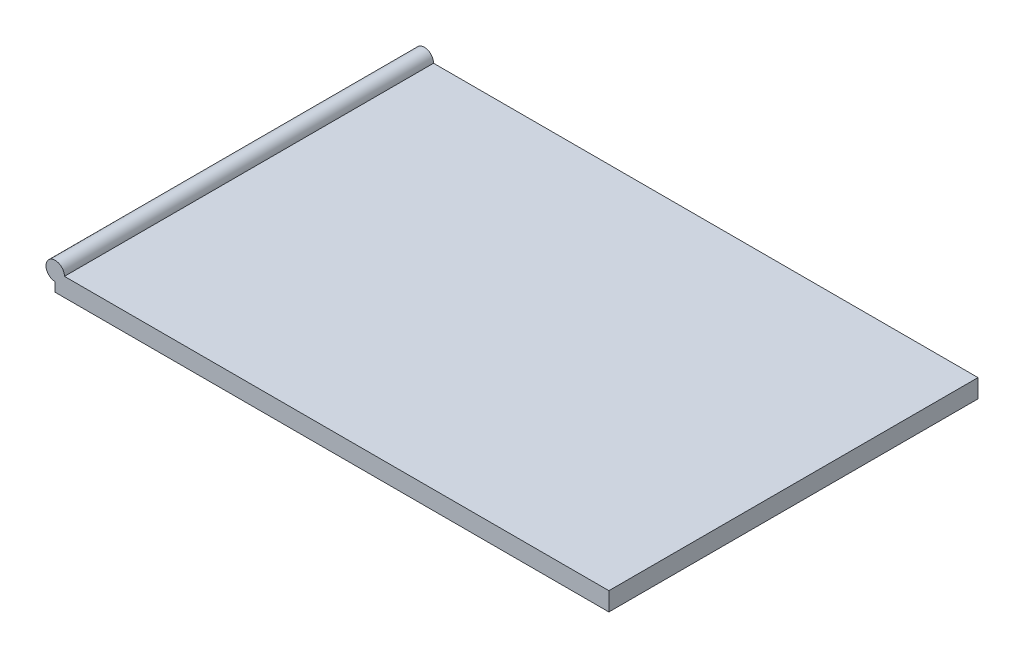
ISO-10303-21;
HEADER;
FILE_DESCRIPTION(('STEP AP214'),'2;1');
FILE_NAME('part.step','',(''),(''),'','','');
FILE_SCHEMA(('AUTOMOTIVE_DESIGN { 1 0 10303 214 1 1 1 1 }'));
ENDSEC;
DATA;
#1=APPLICATION_CONTEXT('core data for automotive mechanical design processes');
#2=APPLICATION_PROTOCOL_DEFINITION('international standard','automotive_design',2000,#1);
#3=PRODUCT_CONTEXT('',#1,'mechanical');
#4=PRODUCT('Part','Part','',(#3));
#5=PRODUCT_RELATED_PRODUCT_CATEGORY('part','',(#4));
#6=PRODUCT_DEFINITION_FORMATION('','',#4);
#7=PRODUCT_DEFINITION_CONTEXT('part definition',#1,'design');
#8=PRODUCT_DEFINITION('design','',#6,#7);
#9=PRODUCT_DEFINITION_SHAPE('','',#8);
#10=(LENGTH_UNIT() NAMED_UNIT(*) SI_UNIT(.MILLI.,.METRE.));
#11=(NAMED_UNIT(*) PLANE_ANGLE_UNIT() SI_UNIT($,.RADIAN.));
#12=(NAMED_UNIT(*) SI_UNIT($,.STERADIAN.) SOLID_ANGLE_UNIT());
#13=UNCERTAINTY_MEASURE_WITH_UNIT(LENGTH_MEASURE(1.E-05),#10,'distance_accuracy_value','');
#14=(GEOMETRIC_REPRESENTATION_CONTEXT(3) GLOBAL_UNCERTAINTY_ASSIGNED_CONTEXT((#13)) GLOBAL_UNIT_ASSIGNED_CONTEXT((#10,
#11,#12)) REPRESENTATION_CONTEXT('',''));
#15=CARTESIAN_POINT('',(0.,0.,0.));
#16=DIRECTION('',(0.,0.,1.));
#17=DIRECTION('',(1.,0.,0.));
#18=AXIS2_PLACEMENT_3D('',#15,#16,#17);
#19=CARTESIAN_POINT('',(0.,0.,50.));
#20=DIRECTION('',(1.,0.,0.));
#21=DIRECTION('',(0.,1.,0.));
#22=AXIS2_PLACEMENT_3D('',#19,#20,#21);
#23=PLANE('',#22);
#24=DIRECTION('',(0.,-1.,0.));
#25=VECTOR('',#24,1.);
#26=CARTESIAN_POINT('',(0.,0.,50.));
#27=LINE('',#26,#25);
#28=CARTESIAN_POINT('',(0.,-2.5,50.));
#29=VERTEX_POINT('',#28);
#30=CARTESIAN_POINT('',(0.,-5.,50.));
#31=VERTEX_POINT('',#30);
#32=EDGE_CURVE('E57',#29,#31,#27,.T.);
#33=ORIENTED_EDGE('',*,*,#32,.F.);
#34=DIRECTION('',(0.,0.,1.));
#35=VECTOR('',#34,1.);
#36=CARTESIAN_POINT('',(0.,-2.5,-57.0710678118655));
#37=LINE('',#36,#35);
#38=CARTESIAN_POINT('',(0.,-2.5,-50.));
#39=VERTEX_POINT('',#38);
#40=EDGE_CURVE('E98',#29,#39,#37,.F.);
#41=ORIENTED_EDGE('',*,*,#40,.T.);
#42=DIRECTION('',(0.,-1.,0.));
#43=VECTOR('',#42,1.);
#44=CARTESIAN_POINT('',(0.,0.,-50.));
#45=LINE('',#44,#43);
#46=CARTESIAN_POINT('',(0.,-5.,-50.));
#47=VERTEX_POINT('',#46);
#48=EDGE_CURVE('E96',#39,#47,#45,.T.);
#49=ORIENTED_EDGE('',*,*,#48,.T.);
#50=DIRECTION('',(0.,0.,-1.));
#51=VECTOR('',#50,1.);
#52=CARTESIAN_POINT('',(0.,-5.,50.));
#53=LINE('',#52,#51);
#54=EDGE_CURVE('E11',#31,#47,#53,.T.);
#55=ORIENTED_EDGE('',*,*,#54,.F.);
#56=EDGE_LOOP('',(#33,#41,#49,#55));
#57=FACE_BOUND('',#56,.T.);
#58=ADVANCED_FACE('F35',(#57),#23,.F.);
#59=CARTESIAN_POINT('',(0.,-5.,50.));
#60=DIRECTION('',(0.,1.,0.));
#61=DIRECTION('',(0.,0.,1.));
#62=AXIS2_PLACEMENT_3D('',#59,#60,#61);
#63=PLANE('',#62);
#64=DIRECTION('',(1.,0.,0.));
#65=VECTOR('',#64,1.);
#66=CARTESIAN_POINT('',(0.,-5.,-50.));
#67=LINE('',#66,#65);
#68=CARTESIAN_POINT('',(150.,-5.,-50.));
#69=VERTEX_POINT('',#68);
#70=EDGE_CURVE('E102',#47,#69,#67,.T.);
#71=ORIENTED_EDGE('',*,*,#70,.T.);
#72=DIRECTION('',(0.,0.,-1.));
#73=VECTOR('',#72,1.);
#74=CARTESIAN_POINT('',(150.,-5.,50.));
#75=LINE('',#74,#73);
#76=CARTESIAN_POINT('',(150.,-5.,50.));
#77=VERTEX_POINT('',#76);
#78=EDGE_CURVE('E42',#77,#69,#75,.T.);
#79=ORIENTED_EDGE('',*,*,#78,.F.);
#80=DIRECTION('',(1.,0.,0.));
#81=VECTOR('',#80,1.);
#82=CARTESIAN_POINT('',(0.,-5.,50.));
#83=LINE('',#82,#81);
#84=EDGE_CURVE('E83',#31,#77,#83,.T.);
#85=ORIENTED_EDGE('',*,*,#84,.F.);
#86=ORIENTED_EDGE('',*,*,#54,.T.);
#87=EDGE_LOOP('',(#71,#79,#85,#86));
#88=FACE_BOUND('',#87,.T.);
#89=ADVANCED_FACE('F90',(#88),#63,.F.);
#90=CARTESIAN_POINT('',(150.,0.,50.));
#91=DIRECTION('',(-1.,0.,0.));
#92=DIRECTION('',(0.,0.,1.));
#93=AXIS2_PLACEMENT_3D('',#90,#91,#92);
#94=PLANE('',#93);
#95=DIRECTION('',(0.,1.,0.));
#96=VECTOR('',#95,1.);
#97=CARTESIAN_POINT('',(150.,0.,-50.));
#98=LINE('',#97,#96);
#99=CARTESIAN_POINT('',(150.,0.,-50.));
#100=VERTEX_POINT('',#99);
#101=EDGE_CURVE('E107',#69,#100,#98,.T.);
#102=ORIENTED_EDGE('',*,*,#101,.T.);
#103=DIRECTION('',(0.,0.,-1.));
#104=VECTOR('',#103,1.);
#105=CARTESIAN_POINT('',(150.,0.,50.));
#106=LINE('',#105,#104);
#107=CARTESIAN_POINT('',(150.,0.,50.));
#108=VERTEX_POINT('',#107);
#109=EDGE_CURVE('E113',#108,#100,#106,.T.);
#110=ORIENTED_EDGE('',*,*,#109,.F.);
#111=DIRECTION('',(0.,1.,0.));
#112=VECTOR('',#111,1.);
#113=CARTESIAN_POINT('',(150.,0.,50.));
#114=LINE('',#113,#112);
#115=EDGE_CURVE('E93',#77,#108,#114,.T.);
#116=ORIENTED_EDGE('',*,*,#115,.F.);
#117=ORIENTED_EDGE('',*,*,#78,.T.);
#118=EDGE_LOOP('',(#102,#110,#116,#117));
#119=FACE_BOUND('',#118,.T.);
#120=ADVANCED_FACE('F117',(#119),#94,.F.);
#121=CARTESIAN_POINT('',(0.,0.,50.));
#122=DIRECTION('',(0.,-1.,0.));
#123=DIRECTION('',(0.,0.,-1.));
#124=AXIS2_PLACEMENT_3D('',#121,#122,#123);
#125=PLANE('',#124);
#126=DIRECTION('',(-1.,0.,0.));
#127=VECTOR('',#126,1.);
#128=CARTESIAN_POINT('',(0.,0.,-50.));
#129=LINE('',#128,#127);
#130=CARTESIAN_POINT('',(2.5,0.,-50.));
#131=VERTEX_POINT('',#130);
#132=EDGE_CURVE('E87',#100,#131,#129,.T.);
#133=ORIENTED_EDGE('',*,*,#132,.T.);
#134=DIRECTION('',(0.,0.,1.));
#135=VECTOR('',#134,1.);
#136=CARTESIAN_POINT('',(2.5,0.,-57.0710678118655));
#137=LINE('',#136,#135);
#138=CARTESIAN_POINT('',(2.5,0.,50.));
#139=VERTEX_POINT('',#138);
#140=EDGE_CURVE('E49',#131,#139,#137,.T.);
#141=ORIENTED_EDGE('',*,*,#140,.T.);
#142=DIRECTION('',(-1.,0.,0.));
#143=VECTOR('',#142,1.);
#144=CARTESIAN_POINT('',(0.,0.,50.));
#145=LINE('',#144,#143);
#146=EDGE_CURVE('E115',#108,#139,#145,.T.);
#147=ORIENTED_EDGE('',*,*,#146,.F.);
#148=ORIENTED_EDGE('',*,*,#109,.T.);
#149=EDGE_LOOP('',(#133,#141,#147,#148));
#150=FACE_BOUND('',#149,.T.);
#151=ADVANCED_FACE('F141',(#150),#125,.F.);
#152=CARTESIAN_POINT('',(0.,-5.,50.));
#153=DIRECTION('',(0.,0.,1.));
#154=DIRECTION('',(1.,0.,0.));
#155=AXIS2_PLACEMENT_3D('',#152,#153,#154);
#156=PLANE('',#155);
#157=CARTESIAN_POINT('',(0.,0.,50.));
#158=DIRECTION('',(0.,0.,1.));
#159=DIRECTION('',(1.,0.,0.));
#160=AXIS2_PLACEMENT_3D('',#157,#158,#159);
#161=CIRCLE('',#160,2.5);
#162=EDGE_CURVE('E86',#139,#29,#161,.T.);
#163=ORIENTED_EDGE('',*,*,#162,.T.);
#164=ORIENTED_EDGE('',*,*,#32,.T.);
#165=ORIENTED_EDGE('',*,*,#84,.T.);
#166=ORIENTED_EDGE('',*,*,#115,.T.);
#167=ORIENTED_EDGE('',*,*,#146,.T.);
#168=EDGE_LOOP('',(#163,#164,#165,#166,#167));
#169=FACE_BOUND('',#168,.T.);
#170=ADVANCED_FACE('F82',(#169),#156,.T.);
#171=CARTESIAN_POINT('',(0.,-5.,-50.));
#172=DIRECTION('',(0.,0.,1.));
#173=DIRECTION('',(1.,0.,0.));
#174=AXIS2_PLACEMENT_3D('',#171,#172,#173);
#175=PLANE('',#174);
#176=ORIENTED_EDGE('',*,*,#48,.F.);
#177=CARTESIAN_POINT('',(0.,0.,-50.));
#178=DIRECTION('',(0.,0.,1.));
#179=DIRECTION('',(1.,0.,0.));
#180=AXIS2_PLACEMENT_3D('',#177,#178,#179);
#181=CIRCLE('',#180,2.5);
#182=EDGE_CURVE('E123',#39,#131,#181,.F.);
#183=ORIENTED_EDGE('',*,*,#182,.T.);
#184=ORIENTED_EDGE('',*,*,#132,.F.);
#185=ORIENTED_EDGE('',*,*,#101,.F.);
#186=ORIENTED_EDGE('',*,*,#70,.F.);
#187=EDGE_LOOP('',(#176,#183,#184,#185,#186));
#188=FACE_BOUND('',#187,.T.);
#189=ADVANCED_FACE('F105',(#188),#175,.F.);
#190=CARTESIAN_POINT('',(0.,0.,-57.0710678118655));
#191=DIRECTION('',(0.,0.,1.));
#192=DIRECTION('',(1.,0.,0.));
#193=AXIS2_PLACEMENT_3D('',#190,#191,#192);
#194=CYLINDRICAL_SURFACE('',#193,2.5);
#195=ORIENTED_EDGE('',*,*,#40,.F.);
#196=ORIENTED_EDGE('',*,*,#162,.F.);
#197=ORIENTED_EDGE('',*,*,#140,.F.);
#198=ORIENTED_EDGE('',*,*,#182,.F.);
#199=EDGE_LOOP('',(#195,#196,#197,#198));
#200=FACE_BOUND('',#199,.T.);
#201=ADVANCED_FACE('F126',(#200),#194,.T.);
#202=CLOSED_SHELL('',(#58,#89,#120,#151,#170,#189,#201));
#203=MANIFOLD_SOLID_BREP('B2',#202);
#204=ADVANCED_BREP_SHAPE_REPRESENTATION('',(#18,#203),#14);
#205=SHAPE_DEFINITION_REPRESENTATION(#9,#204);
ENDSEC;
END-ISO-10303-21;
